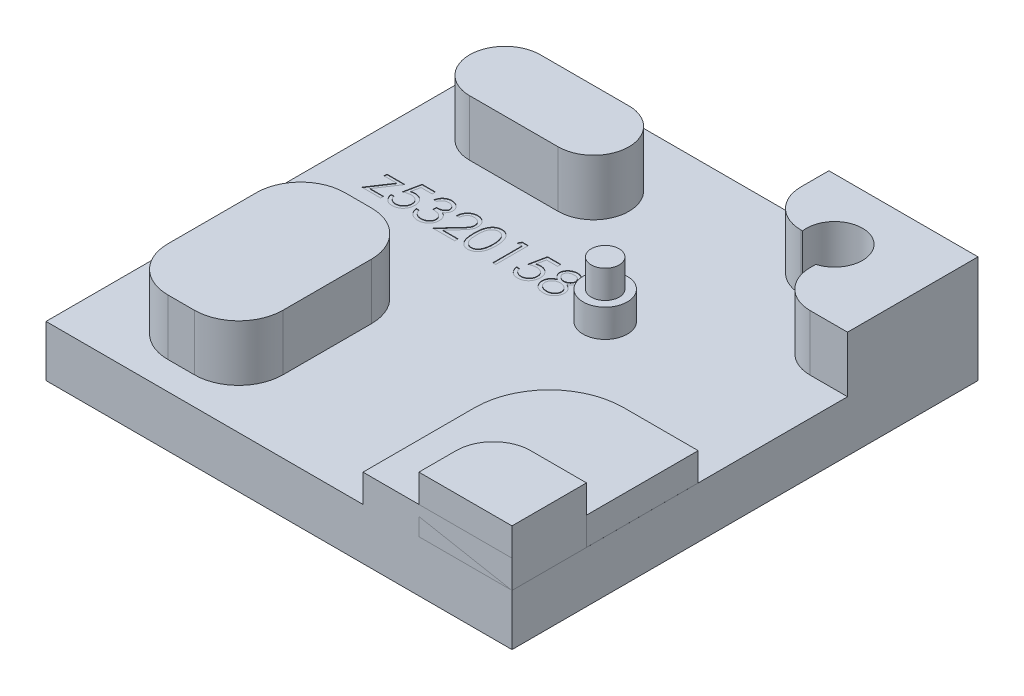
from build123d import *

# Parameters (mm, degrees)
SKETCH1_W            = 50
SKETCH1_H            = 50
BOSS_EXTRUDE4_DEPTH  = 5.5
BOSS_EXTRUDE27_DEPTH = 6
SKETCH10_R           = 2.375
BOSS_EXTRUDE29_DEPTH = 3
CUT_EXTRUDE1_DEPTH   = 0.05
BOSS_EXTRUDE31_DEPTH = 6
BOSS_EXTRUDE32_DEPTH = 6
BOSS_EXTRUDE38_DEPTH = 3
BOSS_EXTRUDE39_DEPTH = 6
SKETCH12_R           = 1.4985
BOSS_EXTRUDE40_DEPTH = 3


with BuildPart() as part:
    # Sketch1 → Boss-Extrude4 (new body)
    with BuildSketch(Plane(origin=(0, 0, 0), x_dir=(1, 0, 0), z_dir=(0, 1, 0))):
        with Locations((2.35426009, -4.035874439)):
            Rectangle(SKETCH1_W, SKETCH1_H)
    extrude(amount=BOSS_EXTRUDE4_DEPTH)

    # Sketch8 → Boss-Extrude27 (add)
    with BuildSketch(Plane(origin=(0, 5.5, 0), x_dir=(1, 0, 0), z_dir=(0, 1, 0))):
        with BuildLine():
            ThreePointArc((11.35426009, 17.964125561), (12.525832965, 15.135698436), (15.35426009, 13.964125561))
            Line((15.35426009, 13.964125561), (15.533330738, 13.964125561))
            ThreePointArc((15.533330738, 13.964125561), (20.09656079, 16.968446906), (19.35426009, 11.555683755))
            Line((19.35426009, 11.555683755), (19.35426009, 10.964125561))
            ThreePointArc((19.35426009, 10.964125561), (20.525832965, 8.135698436), (23.35426009, 6.964125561))
            Line((23.35426009, 6.964125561), (27.35426009, 6.964125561))
            Line((27.35426009, 6.964125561), (27.35426009, 20.964125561))
            Line((27.35426009, 20.964125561), (11.35426009, 20.964125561))
            Line((11.35426009, 20.964125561), (11.35426009, 17.964125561))
        make_face()
    extrude(amount=BOSS_EXTRUDE27_DEPTH)

    # Sketch13 → Cut-Extrude1 (cut)
    # profile 1 of 8: a face of its own
    with BuildSketch(Plane(origin=(0, 5.5, 0), x_dir=(1, 0, 0), z_dir=(0, 1, 0))):
        Polygon((-18.036064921, 2.940033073), (-16.106577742, 2.940033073), (-17.59435819, 0.696443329), (-16.151449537, 0.696443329), (-16.151449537, 0.382340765), (-18.170680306, 0.382340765), (-16.682198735, 2.625930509), (-18.036064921, 2.625930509), align=None)
    # profile 2 of 8: a face of its own
    with BuildSketch(Plane(origin=(0, 5.5, 0), x_dir=(1, 0, 0), z_dir=(0, 1, 0))):
        with BuildLine():
            Line((-13.773244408, 3.882340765), (-13.773244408, 3.523366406))
            Line((-13.773244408, 3.523366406), (-14.963749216, 3.523366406))
            Line((-14.963749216, 3.523366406), (-15.152350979, 2.60279349))
            add(Edge.make_bspline(
                [(-15.152350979, 2.60279349), (-15.115295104, 2.613023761), (-15.043505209, 2.632843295), (-14.937545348, 2.654849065), (-14.836953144, 2.66811451), (-14.771677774, 2.66992582), (-14.740091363, 2.670802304)],
                knots=[0, 0, 0, 0, 1.100273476, 2.13160584, 3.095893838, 4, 4, 4, 4], degree=3))
            add(Edge.make_bspline(
                [(-14.740091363, 2.670802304), (-14.701007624, 2.669956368), (-14.624159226, 2.668293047), (-14.511720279, 2.652321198), (-14.404387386, 2.627181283), (-14.302385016, 2.592060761), (-14.205524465, 2.547151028), (-14.114696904, 2.491051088), (-14.028538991, 2.425517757), (-13.948596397, 2.350172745), (-13.876072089, 2.267251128), (-13.812306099, 2.178093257), (-13.758143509, 2.083565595), (-13.714582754, 1.982764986), (-13.67979842, 1.876805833), (-13.656646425, 1.76457325), (-13.641229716, 1.64712513), (-13.63950733, 1.56682056), (-13.638629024, 1.525870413)],
                knots=[0, 0, 0, 0, 1.052922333, 2.070308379, 3.05430497, 4.020497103, 4.973039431, 5.925935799, 6.892292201, 7.88610001, 8.88166317, 9.857072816, 10.836096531, 11.812156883, 12.81219415, 13.836441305, 14.89672472, 16, 16, 16, 16], degree=3))
            add(Edge.make_bspline(
                [(-13.638629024, 1.525870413), (-13.639294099, 1.497348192), (-13.640615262, 1.440689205), (-13.647333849, 1.356545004), (-13.660269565, 1.274182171), (-13.677637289, 1.193589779), (-13.700179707, 1.114920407), (-13.727468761, 1.037948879), (-13.760864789, 0.963154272), (-13.797496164, 0.889828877), (-13.838742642, 0.81963037), (-13.884521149, 0.753981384), (-13.932886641, 0.691897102), (-13.984928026, 0.634043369), (-14.041129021, 0.580800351), (-14.100808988, 0.53185207), (-14.163491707, 0.486370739), (-14.230146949, 0.446202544), (-14.299289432, 0.409239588), (-14.37191765, 0.378916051), (-14.44637835, 0.351805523), (-14.523743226, 0.330195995), (-14.603837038, 0.31326344), (-14.686791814, 0.30176284), (-14.772172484, 0.293386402), (-14.830047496, 0.292862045), (-14.859282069, 0.292597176)],
                knots=[0, 0, 0, 0, 1.056347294, 2.098418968, 3.122841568, 4.141288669, 5.149314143, 6.15115421, 7.162517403, 8.180376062, 9.185164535, 10.17417709, 11.141909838, 12.097768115, 13.052685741, 14.0056014, 14.954263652, 15.917497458, 16.885230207, 17.854509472, 18.828990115, 19.81800267, 20.826176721, 21.857883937, 22.917946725, 24, 24, 24, 24], degree=3))
            add(Edge.make_bspline(
                [(-14.859282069, 0.292597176), (-14.894156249, 0.293288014), (-14.96276708, 0.294647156), (-15.063287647, 0.308865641), (-15.160002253, 0.329229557), (-15.252132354, 0.359865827), (-15.340503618, 0.398253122), (-15.423926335, 0.446769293), (-15.504532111, 0.501748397), (-15.579044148, 0.56662875), (-15.648200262, 0.637544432), (-15.710106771, 0.714502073), (-15.765240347, 0.796231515), (-15.812718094, 0.883129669), (-15.853216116, 0.9749682), (-15.885031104, 1.072091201), (-15.910709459, 1.173991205), (-15.921572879, 1.244144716), (-15.927090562, 1.279776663)],
                knots=[0, 0, 0, 0, 1.0467383, 2.05933395, 3.04377827, 4.011590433, 4.970194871, 5.932262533, 6.905835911, 7.896367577, 8.894135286, 9.877477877, 10.858688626, 11.851381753, 12.8477658, 13.868841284, 14.917554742, 16, 16, 16, 16], degree=3))
            Line((-15.927090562, 1.279776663), (-15.612987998, 1.279776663))
            add(Edge.make_bspline(
                [(-15.612987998, 1.279776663), (-15.605259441, 1.24640021), (-15.590404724, 1.182248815), (-15.557798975, 1.092117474), (-15.5179331, 1.01179825), (-15.470528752, 0.940228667), (-15.413978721, 0.87781967), (-15.349449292, 0.822202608), (-15.277101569, 0.772027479), (-15.196708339, 0.730204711), (-15.11189526, 0.694535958), (-15.02312805, 0.670784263), (-14.932823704, 0.65408337), (-14.871745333, 0.652411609), (-14.841052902, 0.651571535)],
                knots=[0, 0, 0, 0, 1.136247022, 2.183929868, 3.172523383, 4.106158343, 5.02341133, 5.958108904, 6.928429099, 7.938127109, 8.96079061, 9.975095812, 10.982467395, 12, 12, 12, 12], degree=3))
            add(Edge.make_bspline(
                [(-14.841052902, 0.651571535), (-14.811094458, 0.652392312), (-14.752106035, 0.654008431), (-14.665294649, 0.666447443), (-14.581481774, 0.685605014), (-14.501494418, 0.714274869), (-14.423932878, 0.749119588), (-14.350759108, 0.793834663), (-14.279856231, 0.845294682), (-14.213428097, 0.904251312), (-14.152588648, 0.969221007), (-14.098832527, 1.0386984), (-14.054055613, 1.112815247), (-14.016321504, 1.190288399), (-13.987668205, 1.271966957), (-13.967227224, 1.357468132), (-13.955224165, 1.447003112), (-13.953572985, 1.508072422), (-13.952731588, 1.539191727)],
                knots=[0, 0, 0, 0, 1.027316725, 2.022795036, 3.002884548, 3.971462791, 4.93288096, 5.914575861, 6.907176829, 7.935150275, 8.956128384, 9.956726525, 10.942570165, 11.921478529, 12.907843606, 13.90538589, 14.932640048, 16, 16, 16, 16], degree=3))
            add(Edge.make_bspline(
                [(-13.952731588, 1.539191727), (-13.953390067, 1.567267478), (-13.954678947, 1.622221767), (-13.965209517, 1.702620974), (-13.98352649, 1.778694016), (-14.00895037, 1.85080825), (-14.041229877, 1.919031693), (-14.08067619, 1.983434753), (-14.128029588, 2.043168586), (-14.182121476, 2.09826114), (-14.241379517, 2.149106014), (-14.30682326, 2.192450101), (-14.377083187, 2.228914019), (-14.451312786, 2.260382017), (-14.531277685, 2.282982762), (-14.615394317, 2.299950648), (-14.704571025, 2.30976601), (-14.765541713, 2.311127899), (-14.796882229, 2.311827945)],
                knots=[0, 0, 0, 0, 1.045622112, 2.046656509, 3.013763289, 3.955457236, 4.890082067, 5.820317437, 6.762574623, 7.722996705, 8.69280354, 9.665887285, 10.63943826, 11.638615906, 12.663482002, 13.728887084, 14.832589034, 16, 16, 16, 16], degree=3))
            add(Edge.make_bspline(
                [(-14.796882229, 2.311827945), (-14.824011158, 2.311247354), (-14.880025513, 2.31004858), (-14.96594834, 2.301222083), (-15.056240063, 2.286982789), (-15.150554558, 2.267396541), (-15.249175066, 2.241765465), (-15.351893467, 2.211050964), (-15.458925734, 2.174328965), (-15.531043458, 2.146596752), (-15.568116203, 2.132340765)],
                knots=[0, 0, 0, 0, 0.817624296, 1.688186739, 2.600797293, 3.572016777, 4.590301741, 5.671205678, 6.80286297, 8, 8, 8, 8], degree=3))
            Line((-15.568116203, 2.132340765), (-15.209141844, 3.882340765))
            Line((-15.209141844, 3.882340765), (-13.773244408, 3.882340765))
        make_face()
    # profile 3 of 8: a face of its own
    with BuildSketch(Plane(origin=(0, 5.5, 0), x_dir=(1, 0, 0), z_dir=(0, 1, 0))):
        with BuildLine():
            Line((-12.830936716, 3.074648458), (-13.14503928, 3.074648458))
            add(Edge.make_bspline(
                [(-13.14503928, 3.074648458), (-13.136529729, 3.109880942), (-13.119894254, 3.178757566), (-13.08519668, 3.277164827), (-13.047397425, 3.370288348), (-13.002008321, 3.456384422), (-12.952499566, 3.537183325), (-12.895776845, 3.610852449), (-12.834457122, 3.679265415), (-12.766632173, 3.739978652), (-12.695503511, 3.794956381), (-12.620068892, 3.841831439), (-12.541845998, 3.882155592), (-12.460292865, 3.915375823), (-12.375166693, 3.940401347), (-12.28723707, 3.958558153), (-12.19627357, 3.970349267), (-12.134525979, 3.97150003), (-12.103172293, 3.972084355)],
                knots=[0, 0, 0, 0, 1.162005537, 2.271625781, 3.343758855, 4.383309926, 5.390229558, 6.379919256, 7.361854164, 8.333198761, 9.295911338, 10.242430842, 11.177959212, 12.116337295, 13.062827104, 14.020064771, 14.994644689, 16, 16, 16, 16], degree=3))
            add(Edge.make_bspline(
                [(-12.103172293, 3.972084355), (-12.057489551, 3.970705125), (-11.96712054, 3.967976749), (-11.834357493, 3.943062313), (-11.706330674, 3.90363718), (-11.584441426, 3.849163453), (-11.471222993, 3.78197614), (-11.370486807, 3.702011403), (-11.283598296, 3.610812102), (-11.210703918, 3.510079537), (-11.153628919, 3.402424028), (-11.111542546, 3.291623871), (-11.085920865, 3.1779419), (-11.082600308, 3.10118462), (-11.080936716, 3.062729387)],
                knots=[0, 0, 0, 0, 1.083050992, 2.142477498, 3.193116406, 4.255571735, 5.30263384, 6.308962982, 7.297363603, 8.282367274, 9.249857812, 10.179914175, 11.08814088, 12, 12, 12, 12], degree=3))
            add(Edge.make_bspline(
                [(-11.080936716, 3.062729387), (-11.082100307, 3.025722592), (-11.084377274, 2.953306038), (-11.10371098, 2.847584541), (-11.136247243, 2.74794294), (-11.181317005, 2.653961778), (-11.239658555, 2.566236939), (-11.310331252, 2.484571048), (-11.393833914, 2.40860189), (-11.457112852, 2.365082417), (-11.489690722, 2.342677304)],
                knots=[0, 0, 0, 0, 1.024540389, 2.004866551, 2.965041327, 3.920577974, 4.882998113, 5.874504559, 6.905732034, 8, 8, 8, 8], degree=3))
            add(Edge.make_bspline(
                [(-11.489690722, 2.342677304), (-11.452458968, 2.324699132), (-11.378692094, 2.289079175), (-11.278141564, 2.219223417), (-11.186863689, 2.13856707), (-11.13595997, 2.075624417), (-11.110383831, 2.043999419)],
                knots=[0, 0, 0, 0, 1.015518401, 2.012035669, 3.001164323, 4, 4, 4, 4], degree=3))
            add(Edge.make_bspline(
                [(-11.110383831, 2.043999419), (-11.093542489, 2.020941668), (-11.060135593, 1.975203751), (-11.018900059, 1.901667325), (-10.981490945, 1.827315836), (-10.952340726, 1.75015643), (-10.929766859, 1.671083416), (-10.913630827, 1.58996102), (-10.903606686, 1.506722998), (-10.902171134, 1.450410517), (-10.901449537, 1.422104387)],
                knots=[0, 0, 0, 0, 1.025084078, 2.033381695, 3.024893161, 4.013698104, 4.991890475, 5.976764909, 6.982997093, 8, 8, 8, 8], degree=3))
            add(Edge.make_bspline(
                [(-10.901449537, 1.422104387), (-10.90324405, 1.373094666), (-10.906824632, 1.275305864), (-10.938828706, 1.130831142), (-10.988441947, 0.98960564), (-11.058898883, 0.854530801), (-11.144766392, 0.72815042), (-11.246923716, 0.615074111), (-11.364210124, 0.517875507), (-11.495015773, 0.436665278), (-11.636732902, 0.371747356), (-11.788308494, 0.326689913), (-11.947558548, 0.297343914), (-12.056765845, 0.294197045), (-12.112286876, 0.292597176)],
                knots=[0, 0, 0, 0, 0.955779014, 1.907060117, 2.875433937, 3.871313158, 4.872415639, 5.851225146, 6.836215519, 7.83643374, 8.849228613, 9.86973379, 10.916971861, 12, 12, 12, 12], degree=3))
            add(Edge.make_bspline(
                [(-12.112286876, 0.292597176), (-12.149706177, 0.293465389), (-12.223334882, 0.295173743), (-12.33157838, 0.306852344), (-12.434900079, 0.328182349), (-12.533439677, 0.356885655), (-12.627284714, 0.393277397), (-12.716148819, 0.438596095), (-12.800578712, 0.491907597), (-12.879777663, 0.553841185), (-12.953736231, 0.623122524), (-13.020488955, 0.700981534), (-13.081148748, 0.785978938), (-13.134091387, 0.879101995), (-13.18172834, 0.979147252), (-13.220909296, 1.08739575), (-13.255394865, 1.202879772), (-13.271428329, 1.283357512), (-13.279654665, 1.324648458)],
                knots=[0, 0, 0, 0, 1.048658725, 2.063410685, 3.046034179, 4.001477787, 4.936774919, 5.862367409, 6.792675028, 7.730719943, 8.675894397, 9.627829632, 10.600096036, 11.597688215, 12.626045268, 13.701542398, 14.82072376, 16, 16, 16, 16], degree=3))
            Line((-13.279654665, 1.324648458), (-12.965552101, 1.324648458))
            add(Edge.make_bspline(
                [(-12.965552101, 1.324648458), (-12.957368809, 1.297699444), (-12.941451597, 1.245281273), (-12.914357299, 1.169840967), (-12.883489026, 1.100682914), (-12.850374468, 1.037299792), (-12.815596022, 0.979067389), (-12.776681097, 0.92752552), (-12.736511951, 0.880410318), (-12.706232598, 0.853865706), (-12.691413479, 0.840874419)],
                knots=[0, 0, 0, 0, 1.198163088, 2.33053128, 3.407730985, 4.417276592, 5.372219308, 6.28897303, 7.162600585, 8, 8, 8, 8], degree=3))
            add(Edge.make_bspline(
                [(-12.691413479, 0.840874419), (-12.671816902, 0.825766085), (-12.632684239, 0.795596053), (-12.568916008, 0.757094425), (-12.501851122, 0.7237334), (-12.430036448, 0.698249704), (-12.355021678, 0.676672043), (-12.275594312, 0.662551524), (-12.192455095, 0.652863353), (-12.135687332, 0.652008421), (-12.106677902, 0.651571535)],
                knots=[0, 0, 0, 0, 0.946170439, 1.889420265, 2.845303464, 3.807233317, 4.801018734, 5.828864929, 6.890507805, 8, 8, 8, 8], degree=3))
            add(Edge.make_bspline(
                [(-12.106677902, 0.651571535), (-12.073924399, 0.65218744), (-12.009877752, 0.653391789), (-11.916422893, 0.664467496), (-11.827515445, 0.68059791), (-11.74414252, 0.705510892), (-11.665212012, 0.736291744), (-11.591830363, 0.774940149), (-11.523034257, 0.820284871), (-11.459704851, 0.87182403), (-11.402759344, 0.928245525), (-11.35261983, 0.987258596), (-11.309995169, 1.048614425), (-11.275611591, 1.112652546), (-11.24846104, 1.179107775), (-11.22997784, 1.248166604), (-11.217126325, 1.319263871), (-11.216079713, 1.36759284), (-11.215552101, 1.39195615)],
                knots=[0, 0, 0, 0, 1.217147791, 2.380027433, 3.494444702, 4.572153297, 5.609568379, 6.639424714, 7.649109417, 8.668170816, 9.669597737, 10.625200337, 11.543417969, 12.441394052, 13.322311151, 14.205496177, 15.095365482, 16, 16, 16, 16], degree=3))
            add(Edge.make_bspline(
                [(-11.215552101, 1.39195615), (-11.217082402, 1.424567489), (-11.220135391, 1.489627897), (-11.24344397, 1.585345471), (-11.281782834, 1.677568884), (-11.335455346, 1.764724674), (-11.400791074, 1.845500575), (-11.477155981, 1.917572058), (-11.565184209, 1.977042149), (-11.646204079, 2.018130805), (-11.717969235, 2.04616788), (-11.779384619, 2.064842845), (-11.848141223, 2.080656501), (-11.923407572, 2.095368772), (-12.005750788, 2.10789012), (-12.095081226, 2.118331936), (-12.191416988, 2.126686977), (-12.258108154, 2.130418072), (-12.292475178, 2.132340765)],
                knots=[0, 0, 0, 0, 1.07054697, 2.135767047, 3.216561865, 4.33974944, 5.486079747, 6.621378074, 7.775625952, 8.963672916, 9.598146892, 10.304877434, 11.070270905, 11.915000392, 12.823868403, 13.805723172, 14.86925407, 16, 16, 16, 16], degree=3))
            Line((-12.292475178, 2.132340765), (-12.292475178, 2.491315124))
            add(Edge.make_bspline(
                [(-12.292475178, 2.491315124), (-12.249174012, 2.492049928), (-12.164357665, 2.493489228), (-12.040463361, 2.510897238), (-11.921990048, 2.534977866), (-11.811563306, 2.571863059), (-11.710914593, 2.614703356), (-11.623594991, 2.664555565), (-11.550827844, 2.719970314), (-11.492966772, 2.781802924), (-11.449437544, 2.848117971), (-11.417610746, 2.917234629), (-11.39881042, 2.98975869), (-11.396300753, 3.039253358), (-11.39503928, 3.064131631)],
                knots=[0, 0, 0, 0, 1.321986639, 2.589447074, 3.816329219, 5.01088745, 6.139805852, 7.153945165, 8.075214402, 8.924034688, 9.728124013, 10.488707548, 11.240355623, 12, 12, 12, 12], degree=3))
            add(Edge.make_bspline(
                [(-11.39503928, 3.064131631), (-11.395453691, 3.082409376), (-11.396278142, 3.118772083), (-11.40667542, 3.171897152), (-11.422299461, 3.223398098), (-11.44377919, 3.273055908), (-11.472529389, 3.320526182), (-11.506935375, 3.366213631), (-11.547903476, 3.40985741), (-11.594848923, 3.450537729), (-11.645260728, 3.489306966), (-11.700510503, 3.522220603), (-11.758932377, 3.550365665), (-11.820591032, 3.573575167), (-11.885686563, 3.591034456), (-11.95391312, 3.603570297), (-12.025400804, 3.611407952), (-12.074172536, 3.612536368), (-12.098965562, 3.613109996)],
                knots=[0, 0, 0, 0, 0.884392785, 1.759457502, 2.611959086, 3.489218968, 4.37281399, 5.2945488, 6.255912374, 7.266815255, 8.301784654, 9.332968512, 10.37626691, 11.440494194, 12.520033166, 13.637162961, 14.798855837, 16, 16, 16, 16], degree=3))
            add(Edge.make_bspline(
                [(-12.098965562, 3.613109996), (-12.13881723, 3.611718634), (-12.216656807, 3.60900098), (-12.328871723, 3.585197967), (-12.433191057, 3.547219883), (-12.512929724, 3.501886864), (-12.571812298, 3.45713643), (-12.613889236, 3.418054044), (-12.655209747, 3.37462122), (-12.693055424, 3.324162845), (-12.7313294, 3.270096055), (-12.766173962, 3.209672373), (-12.800033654, 3.144467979), (-12.820436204, 3.098372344), (-12.830936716, 3.074648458)],
                knots=[0, 0, 0, 0, 1.472543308, 2.876219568, 4.221790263, 5.565193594, 6.249813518, 6.953379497, 7.687249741, 8.463570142, 9.283606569, 10.136032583, 11.040678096, 12, 12, 12, 12], degree=3))
        make_face()
    # profile 4 of 8: a face of its own
    with BuildSketch(Plane(origin=(0, 5.5, 0), x_dir=(1, 0, 0), z_dir=(0, 1, 0))):
        with BuildLine():
            Line((-10.138629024, 2.805417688), (-10.452731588, 2.805417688))
            add(Edge.make_bspline(
                [(-10.452731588, 2.805417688), (-10.450684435, 2.847088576), (-10.446663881, 2.928929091), (-10.427835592, 3.048252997), (-10.400894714, 3.162307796), (-10.36280326, 3.27017771), (-10.315496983, 3.372816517), (-10.258766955, 3.469816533), (-10.191573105, 3.560807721), (-10.115366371, 3.644946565), (-10.032597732, 3.722134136), (-9.943291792, 3.788789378), (-9.849446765, 3.84510705), (-9.751347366, 3.892188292), (-9.647886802, 3.927528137), (-9.540003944, 3.953749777), (-9.427224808, 3.969526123), (-9.350384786, 3.971221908), (-9.311305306, 3.972084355)],
                knots=[0, 0, 0, 0, 1.10065271, 2.161652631, 3.183658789, 4.190468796, 5.17591951, 6.163126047, 7.15150782, 8.156236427, 9.156009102, 10.134482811, 11.092018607, 12.041330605, 13.001268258, 13.972401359, 14.968799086, 16, 16, 16, 16], degree=3))
            add(Edge.make_bspline(
                [(-9.311305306, 3.972084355), (-9.272927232, 3.971185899), (-9.197515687, 3.969420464), (-9.087453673, 3.954259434), (-8.982676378, 3.930513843), (-8.883388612, 3.897198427), (-8.790382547, 3.852413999), (-8.702959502, 3.79861646), (-8.620078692, 3.736396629), (-8.545471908, 3.663142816), (-8.476963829, 3.584940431), (-8.417861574, 3.501452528), (-8.36724841, 3.415223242), (-8.32506073, 3.32559504), (-8.294004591, 3.231724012), (-8.270426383, 3.134976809), (-8.25709897, 3.034351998), (-8.255053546, 2.966245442), (-8.254013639, 2.931619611)],
                knots=[0, 0, 0, 0, 1.111607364, 2.184268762, 3.212621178, 4.221274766, 5.211760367, 6.196651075, 7.1921475, 8.207485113, 9.220403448, 10.201281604, 11.166441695, 12.114753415, 13.065576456, 14.026450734, 14.996634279, 16, 16, 16, 16], degree=3))
            add(Edge.make_bspline(
                [(-8.254013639, 2.931619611), (-8.255706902, 2.882871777), (-8.259063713, 2.786231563), (-8.28777809, 2.6442167), (-8.332624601, 2.506623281), (-8.386621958, 2.395885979), (-8.441094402, 2.306652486), (-8.490181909, 2.233183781), (-8.54764672, 2.154078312), (-8.614325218, 2.069600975), (-8.688838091, 1.97909007), (-8.771860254, 1.882600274), (-8.863983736, 1.781128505), (-8.928642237, 1.711822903), (-8.962146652, 1.675910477)],
                knots=[0, 0, 0, 0, 1.184426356, 2.348067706, 3.509069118, 4.696110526, 5.333549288, 6.050745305, 6.844228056, 7.710549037, 8.667450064, 9.695053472, 10.805634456, 12, 12, 12, 12], degree=3))
            Line((-8.962146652, 1.675910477), (-9.837847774, 0.741315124))
            Line((-9.837847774, 0.741315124), (-8.209141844, 0.741315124))
            Line((-8.209141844, 0.741315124), (-8.209141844, 0.382340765))
            Line((-8.209141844, 0.382340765), (-10.587346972, 0.382340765))
            Line((-10.587346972, 0.382340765), (-9.229975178, 1.830858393))
            add(Edge.make_bspline(
                [(-9.229975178, 1.830858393), (-9.196927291, 1.8653567), (-9.133449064, 1.931620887), (-9.043666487, 2.028363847), (-8.963027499, 2.118113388), (-8.891010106, 2.200699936), (-8.8291766, 2.277331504), (-8.774304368, 2.345526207), (-8.730338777, 2.408280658), (-8.682623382, 2.481021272), (-8.6364094, 2.569833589), (-8.596697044, 2.678367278), (-8.572482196, 2.790094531), (-8.56957736, 2.865596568), (-8.568116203, 2.90357474)],
                knots=[0, 0, 0, 0, 1.329631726, 2.553950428, 3.673215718, 4.687767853, 5.603093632, 6.413772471, 7.123043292, 7.734684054, 8.834405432, 9.900288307, 10.943827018, 12, 12, 12, 12], degree=3))
            add(Edge.make_bspline(
                [(-8.568116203, 2.90357474), (-8.568751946, 2.927456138), (-8.570004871, 2.974521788), (-8.581062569, 3.043527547), (-8.597773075, 3.110092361), (-8.621718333, 3.17442098), (-8.653325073, 3.235866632), (-8.691798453, 3.294504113), (-8.736188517, 3.351193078), (-8.787539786, 3.404346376), (-8.843951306, 3.453027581), (-8.903545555, 3.496151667), (-8.96659566, 3.532190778), (-9.032835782, 3.561734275), (-9.102081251, 3.584909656), (-9.174465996, 3.600968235), (-9.249790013, 3.611050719), (-9.301223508, 3.612414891), (-9.327431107, 3.613109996)],
                knots=[0, 0, 0, 0, 0.991446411, 1.95395049, 2.89581595, 3.838931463, 4.798493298, 5.75982156, 6.748411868, 7.785213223, 8.824556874, 9.840280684, 10.836137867, 11.835679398, 12.848801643, 13.863922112, 14.911575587, 16, 16, 16, 16], degree=3))
            add(Edge.make_bspline(
                [(-9.327431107, 3.613109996), (-9.35480194, 3.612394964), (-9.408553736, 3.610990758), (-9.487472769, 3.601168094), (-9.562758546, 3.584222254), (-9.634600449, 3.56104558), (-9.703120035, 3.531587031), (-9.767984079, 3.494895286), (-9.829046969, 3.451111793), (-9.886423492, 3.401471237), (-9.939287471, 3.346203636), (-9.985734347, 3.284593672), (-10.026318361, 3.217766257), (-10.061727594, 3.145901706), (-10.090483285, 3.068347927), (-10.112456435, 2.985380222), (-10.129843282, 2.89735884), (-10.135651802, 2.836573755), (-10.138629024, 2.805417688)],
                knots=[0, 0, 0, 0, 1.031018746, 2.02475058, 2.990194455, 3.934040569, 4.864654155, 5.795059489, 6.735614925, 7.690564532, 8.649604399, 9.611025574, 10.590972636, 11.591080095, 12.624614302, 13.701020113, 14.821632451, 16, 16, 16, 16], degree=3))
        make_face()
    # profile 5 of 8: a face of its own
    with BuildSketch(Plane(origin=(0, 5.5, 0), x_dir=(1, 0, 0), z_dir=(0, 1, 0))):
        with BuildLine():
            add(Edge.make_bspline(
                [(-7.89503928, 2.130938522), (-7.894711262, 2.187035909), (-7.894074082, 2.296005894), (-7.886985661, 2.454790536), (-7.875210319, 2.603750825), (-7.859072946, 2.742893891), (-7.839434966, 2.872255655), (-7.813219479, 2.991490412), (-7.783406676, 3.101150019), (-7.748854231, 3.201592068), (-7.709866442, 3.294169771), (-7.667432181, 3.380594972), (-7.619867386, 3.460736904), (-7.569890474, 3.535874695), (-7.515478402, 3.604778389), (-7.458179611, 3.668421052), (-7.395757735, 3.725331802), (-7.330334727, 3.777178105), (-7.261318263, 3.822627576), (-7.190675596, 3.862660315), (-7.117920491, 3.896860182), (-7.042854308, 3.923750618), (-6.96615175, 3.945961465), (-6.887544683, 3.961150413), (-6.806903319, 3.970707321), (-6.752471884, 3.971620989), (-6.724867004, 3.972084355)],
                knots=[0, 0, 0, 0, 1.646270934, 3.197905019, 4.663502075, 6.030701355, 7.308322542, 8.50163776, 9.611534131, 10.641858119, 11.616356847, 12.558055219, 13.465016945, 14.349605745, 15.204443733, 16.039544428, 16.859896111, 17.680448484, 18.487036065, 19.28249412, 20.06191084, 20.843045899, 21.620316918, 22.403196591, 23.190181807, 24, 24, 24, 24], degree=3))
            add(Edge.make_bspline(
                [(-6.724867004, 3.972084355), (-6.697031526, 3.97159654), (-6.641675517, 3.970626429), (-6.559835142, 3.961302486), (-6.47988546, 3.945831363), (-6.402167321, 3.923910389), (-6.326042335, 3.896714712), (-6.252105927, 3.862627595), (-6.179898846, 3.822948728), (-6.110568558, 3.77632485), (-6.043353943, 3.724342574), (-5.97990598, 3.665579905), (-5.920218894, 3.600630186), (-5.863543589, 3.530188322), (-5.811487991, 3.452903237), (-5.761914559, 3.370119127), (-5.717542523, 3.280388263), (-5.674807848, 3.185207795), (-5.637920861, 3.081944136), (-5.604654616, 2.971179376), (-5.577775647, 2.851605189), (-5.555386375, 2.723848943), (-5.538041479, 2.58744146), (-5.525408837, 2.442675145), (-5.518735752, 2.289454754), (-5.517479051, 2.184696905), (-5.516834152, 2.130938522)],
                knots=[0, 0, 0, 0, 0.810914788, 1.612654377, 2.396697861, 3.181598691, 3.963628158, 4.749916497, 5.551656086, 6.361998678, 7.18212741, 8.025565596, 8.878627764, 9.750805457, 10.657531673, 11.591944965, 12.560506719, 13.57287815, 14.630710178, 15.753379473, 16.941251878, 18.199788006, 19.531962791, 20.947069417, 22.433333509, 24, 24, 24, 24], degree=3))
            add(Edge.make_bspline(
                [(-5.516834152, 2.130938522), (-5.517485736, 2.077414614), (-5.518755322, 1.973125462), (-5.525334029, 1.820594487), (-5.53829266, 1.676596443), (-5.554502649, 1.540785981), (-5.576953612, 1.413728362), (-5.604558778, 1.294983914), (-5.635209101, 1.184039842), (-5.673043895, 1.08180503), (-5.714454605, 0.986853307), (-5.759509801, 0.898186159), (-5.807779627, 0.815019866), (-5.860368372, 0.738020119), (-5.916421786, 0.666641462), (-5.977139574, 0.60214384), (-6.040810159, 0.542973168), (-6.108222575, 0.49032154), (-6.178634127, 0.444236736), (-6.250593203, 0.403022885), (-6.325376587, 0.36979019), (-6.40128954, 0.341255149), (-6.479417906, 0.319454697), (-6.559664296, 0.304380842), (-6.641620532, 0.293808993), (-6.697022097, 0.293002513), (-6.724867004, 0.292597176)],
                knots=[0, 0, 0, 0, 1.561518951, 3.042555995, 4.452378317, 5.7783523, 7.031515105, 8.214008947, 9.334062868, 10.386615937, 11.391082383, 12.354592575, 13.286541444, 14.194233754, 15.072674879, 15.931287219, 16.775624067, 17.606195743, 18.42308326, 19.229000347, 20.022332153, 20.807536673, 21.593273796, 22.3848459, 23.188221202, 24, 24, 24, 24], degree=3))
            add(Edge.make_bspline(
                [(-6.724867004, 0.292597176), (-6.752471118, 0.293063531), (-6.806901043, 0.293983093), (-6.887553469, 0.303496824), (-6.965835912, 0.318792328), (-7.042134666, 0.340208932), (-7.116841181, 0.366423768), (-7.188937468, 0.400577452), (-7.259225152, 0.439911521), (-7.327516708, 0.484706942), (-7.392528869, 0.536028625), (-7.454627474, 0.592792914), (-7.512252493, 0.656416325), (-7.565886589, 0.725894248), (-7.616860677, 0.800587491), (-7.66375005, 0.881515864), (-7.707120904, 0.968358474), (-7.746764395, 1.061676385), (-7.781913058, 1.162831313), (-7.812960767, 1.272980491), (-7.837474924, 1.393096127), (-7.858457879, 1.522213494), (-7.875382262, 1.660887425), (-7.886936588, 1.809193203), (-7.894077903, 1.967038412), (-7.894712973, 2.075308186), (-7.89503928, 2.130938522)],
                knots=[0, 0, 0, 0, 0.810891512, 1.598919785, 2.382837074, 3.152667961, 3.926044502, 4.706494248, 5.493654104, 6.291793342, 7.103789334, 7.925228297, 8.761435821, 9.622817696, 10.50288917, 11.416980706, 12.369136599, 13.353924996, 14.394355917, 15.514179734, 16.714354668, 17.994756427, 19.357759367, 20.818452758, 22.365282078, 24, 24, 24, 24], degree=3))
        make_face()
        with BuildLine():
            add(Edge.make_bspline(
                [(-7.580936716, 2.132340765), (-7.580817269, 2.085592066), (-7.580585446, 1.994862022), (-7.574529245, 1.863018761), (-7.566279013, 1.740048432), (-7.555637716, 1.625794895), (-7.539834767, 1.520644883), (-7.52212798, 1.4238752), (-7.50057989, 1.335997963), (-7.475084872, 1.256410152), (-7.446045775, 1.183761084), (-7.414339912, 1.116159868), (-7.380279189, 1.052807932), (-7.342160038, 0.994274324), (-7.300644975, 0.94036816), (-7.256671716, 0.890135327), (-7.208599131, 0.845338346), (-7.142095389, 0.791611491), (-7.054298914, 0.736092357), (-6.943678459, 0.687746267), (-6.830010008, 0.657363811), (-6.752858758, 0.653500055), (-6.714350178, 0.651571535)],
                knots=[0, 0, 0, 0, 1.459021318, 2.831673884, 4.118529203, 5.306027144, 6.411944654, 7.436330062, 8.375795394, 9.233974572, 10.042671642, 10.816086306, 11.563610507, 12.285937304, 12.993564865, 13.685989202, 14.367179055, 15.041617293, 16.353048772, 17.594441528, 18.799311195, 20, 20, 20, 20], degree=3))
            add(Edge.make_bspline(
                [(-6.714350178, 0.651571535), (-6.675592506, 0.653169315), (-6.598157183, 0.656361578), (-6.485023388, 0.687160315), (-6.375193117, 0.733629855), (-6.289121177, 0.78857736), (-6.223638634, 0.84090569), (-6.176721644, 0.885520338), (-6.133659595, 0.935476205), (-6.09281752, 0.989375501), (-6.055358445, 1.048247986), (-6.021295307, 1.111810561), (-5.990211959, 1.180239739), (-5.972502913, 1.228009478), (-5.963448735, 1.252432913)],
                knots=[0, 0, 0, 0, 1.353760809, 2.704726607, 4.075137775, 5.516104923, 6.260822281, 7.007110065, 7.778089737, 8.566572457, 9.372053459, 10.217411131, 11.088608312, 12, 12, 12, 12], degree=3))
            add(Edge.make_bspline(
                [(-5.963448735, 1.252432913), (-5.952896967, 1.283662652), (-5.931472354, 1.347072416), (-5.903860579, 1.445436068), (-5.88211518, 1.548638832), (-5.862551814, 1.656063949), (-5.849198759, 1.76850365), (-5.838450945, 1.885610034), (-5.832120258, 2.007471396), (-5.831335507, 2.090266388), (-5.830936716, 2.132340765)],
                knots=[0, 0, 0, 0, 0.884706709, 1.796334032, 2.740027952, 3.714592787, 4.726048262, 5.777819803, 6.87074269, 8, 8, 8, 8], degree=3))
            add(Edge.make_bspline(
                [(-5.830936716, 2.132340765), (-5.831486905, 2.174408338), (-5.832563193, 2.256701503), (-5.836677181, 2.377219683), (-5.847300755, 2.491687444), (-5.859099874, 2.600597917), (-5.876497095, 2.70334822), (-5.895254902, 2.800798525), (-5.920456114, 2.89174155), (-5.947375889, 2.977601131), (-5.978186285, 3.057401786), (-6.012102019, 3.131515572), (-6.048323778, 3.200300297), (-6.087666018, 3.263567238), (-6.129661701, 3.321599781), (-6.175419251, 3.373234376), (-6.223123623, 3.420071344), (-6.289940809, 3.473533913), (-6.377415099, 3.528045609), (-6.486260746, 3.578211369), (-6.599531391, 3.607019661), (-6.676104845, 3.611081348), (-6.714350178, 3.613109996)],
                knots=[0, 0, 0, 0, 1.31362396, 2.569729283, 3.763502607, 4.902122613, 5.988968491, 7.01645872, 7.998833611, 8.933434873, 9.825090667, 10.667526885, 11.477055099, 12.250526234, 12.991942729, 13.710640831, 14.402115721, 15.076753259, 16.378508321, 17.609869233, 18.806226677, 20, 20, 20, 20], degree=3))
            add(Edge.make_bspline(
                [(-6.714350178, 3.613109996), (-6.75306077, 3.611078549), (-6.830552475, 3.607011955), (-6.94500043, 3.578318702), (-7.054704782, 3.528305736), (-7.141947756, 3.473353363), (-7.208811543, 3.421015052), (-7.255894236, 3.375628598), (-7.300040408, 3.325982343), (-7.340708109, 3.271580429), (-7.378797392, 3.213115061), (-7.413778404, 3.150126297), (-7.445295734, 3.082294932), (-7.47438027, 3.009678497), (-7.499953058, 2.930097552), (-7.521047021, 2.842328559), (-7.540534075, 2.745866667), (-7.554329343, 2.640147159), (-7.566593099, 2.525865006), (-7.574474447, 2.402587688), (-7.580605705, 2.270523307), (-7.580824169, 2.179324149), (-7.580936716, 2.132340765)],
                knots=[0, 0, 0, 0, 1.207732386, 2.417664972, 3.655092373, 4.956220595, 5.625982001, 6.301752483, 6.994047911, 7.697131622, 8.419323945, 9.170223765, 9.943494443, 10.752040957, 11.610060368, 12.549350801, 13.567764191, 14.679664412, 15.874934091, 17.154273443, 18.533957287, 20, 20, 20, 20], degree=3))
        make_face(mode=Mode.SUBTRACT)
    # profile 6 of 8: a face of its own
    with BuildSketch(Plane(origin=(0, 5.5, 0), x_dir=(1, 0, 0), z_dir=(0, 1, 0))):
        Polygon((-4.458841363, 3.882340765), (-3.811705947, 3.882340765), (-3.811705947, 0.382340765), (-4.125808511, 0.382340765), (-4.125808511, 3.523366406), (-4.664270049, 3.523366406), align=None)
    # profile 7 of 8: a face of its own
    with BuildSketch(Plane(origin=(0, 5.5, 0), x_dir=(1, 0, 0), z_dir=(0, 1, 0))):
        with BuildLine():
            Line((-0.311705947, 3.882340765), (-0.311705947, 3.523366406))
            Line((-0.311705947, 3.523366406), (-1.502210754, 3.523366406))
            Line((-1.502210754, 3.523366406), (-1.690812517, 2.60279349))
            add(Edge.make_bspline(
                [(-1.690812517, 2.60279349), (-1.653756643, 2.613023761), (-1.581966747, 2.632843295), (-1.476006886, 2.654849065), (-1.375414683, 2.66811451), (-1.310139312, 2.66992582), (-1.278552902, 2.670802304)],
                knots=[0, 0, 0, 0, 1.100273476, 2.13160584, 3.095893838, 4, 4, 4, 4], degree=3))
            add(Edge.make_bspline(
                [(-1.278552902, 2.670802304), (-1.239469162, 2.669956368), (-1.162620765, 2.668293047), (-1.050181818, 2.652321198), (-0.942848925, 2.627181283), (-0.840846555, 2.592060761), (-0.743986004, 2.547151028), (-0.653158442, 2.491051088), (-0.567000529, 2.425517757), (-0.487057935, 2.350172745), (-0.414533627, 2.267251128), (-0.350767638, 2.178093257), (-0.296605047, 2.083565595), (-0.253044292, 1.982764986), (-0.218259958, 1.876805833), (-0.195107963, 1.76457325), (-0.179691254, 1.64712513), (-0.177968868, 1.56682056), (-0.177090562, 1.525870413)],
                knots=[0, 0, 0, 0, 1.052922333, 2.070308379, 3.05430497, 4.020497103, 4.973039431, 5.925935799, 6.892292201, 7.88610001, 8.88166317, 9.857072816, 10.836096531, 11.812156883, 12.81219415, 13.836441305, 14.89672472, 16, 16, 16, 16], degree=3))
            add(Edge.make_bspline(
                [(-0.177090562, 1.525870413), (-0.177755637, 1.497348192), (-0.1790768, 1.440689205), (-0.185795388, 1.356545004), (-0.198731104, 1.274182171), (-0.216098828, 1.193589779), (-0.238641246, 1.114920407), (-0.2659303, 1.037948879), (-0.299326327, 0.963154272), (-0.335957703, 0.889828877), (-0.377204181, 0.81963037), (-0.422982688, 0.753981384), (-0.471348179, 0.691897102), (-0.523389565, 0.634043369), (-0.57959056, 0.580800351), (-0.639270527, 0.53185207), (-0.701953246, 0.486370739), (-0.768608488, 0.446202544), (-0.837750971, 0.409239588), (-0.910379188, 0.378916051), (-0.984839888, 0.351805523), (-1.062204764, 0.330195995), (-1.142298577, 0.31326344), (-1.225253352, 0.30176284), (-1.310634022, 0.293386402), (-1.368509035, 0.292862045), (-1.397743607, 0.292597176)],
                knots=[0, 0, 0, 0, 1.056347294, 2.098418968, 3.122841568, 4.141288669, 5.149314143, 6.15115421, 7.162517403, 8.180376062, 9.185164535, 10.17417709, 11.141909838, 12.097768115, 13.052685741, 14.0056014, 14.954263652, 15.917497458, 16.885230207, 17.854509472, 18.828990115, 19.81800267, 20.826176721, 21.857883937, 22.917946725, 24, 24, 24, 24], degree=3))
            add(Edge.make_bspline(
                [(-1.397743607, 0.292597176), (-1.432617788, 0.293288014), (-1.501228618, 0.294647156), (-1.601749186, 0.308865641), (-1.698463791, 0.329229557), (-1.790593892, 0.359865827), (-1.878965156, 0.398253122), (-1.962387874, 0.446769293), (-2.04299365, 0.501748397), (-2.117505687, 0.56662875), (-2.1866618, 0.637544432), (-2.248568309, 0.714502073), (-2.303701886, 0.796231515), (-2.351179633, 0.883129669), (-2.391677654, 0.9749682), (-2.423492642, 1.072091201), (-2.449170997, 1.173991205), (-2.460034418, 1.244144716), (-2.465552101, 1.279776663)],
                knots=[0, 0, 0, 0, 1.0467383, 2.05933395, 3.04377827, 4.011590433, 4.970194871, 5.932262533, 6.905835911, 7.896367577, 8.894135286, 9.877477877, 10.858688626, 11.851381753, 12.8477658, 13.868841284, 14.917554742, 16, 16, 16, 16], degree=3))
            Line((-2.465552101, 1.279776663), (-2.151449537, 1.279776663))
            add(Edge.make_bspline(
                [(-2.151449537, 1.279776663), (-2.143720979, 1.24640021), (-2.128866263, 1.182248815), (-2.096260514, 1.092117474), (-2.056394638, 1.01179825), (-2.00899029, 0.940228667), (-1.95244026, 0.87781967), (-1.887910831, 0.822202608), (-1.815563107, 0.772027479), (-1.735169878, 0.730204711), (-1.650356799, 0.694535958), (-1.561589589, 0.670784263), (-1.471285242, 0.65408337), (-1.410206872, 0.652411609), (-1.37951444, 0.651571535)],
                knots=[0, 0, 0, 0, 1.136247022, 2.183929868, 3.172523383, 4.106158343, 5.02341133, 5.958108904, 6.928429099, 7.938127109, 8.96079061, 9.975095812, 10.982467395, 12, 12, 12, 12], degree=3))
            add(Edge.make_bspline(
                [(-1.37951444, 0.651571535), (-1.349555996, 0.652392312), (-1.290567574, 0.654008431), (-1.203756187, 0.666447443), (-1.119943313, 0.685605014), (-1.039955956, 0.714274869), (-0.962394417, 0.749119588), (-0.889220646, 0.793834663), (-0.818317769, 0.845294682), (-0.751889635, 0.904251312), (-0.691050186, 0.969221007), (-0.637294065, 1.0386984), (-0.592517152, 1.112815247), (-0.554783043, 1.190288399), (-0.526129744, 1.271966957), (-0.505688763, 1.357468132), (-0.493685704, 1.447003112), (-0.492034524, 1.508072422), (-0.491193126, 1.539191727)],
                knots=[0, 0, 0, 0, 1.027316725, 2.022795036, 3.002884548, 3.971462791, 4.93288096, 5.914575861, 6.907176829, 7.935150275, 8.956128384, 9.956726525, 10.942570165, 11.921478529, 12.907843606, 13.90538589, 14.932640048, 16, 16, 16, 16], degree=3))
            add(Edge.make_bspline(
                [(-0.491193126, 1.539191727), (-0.491851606, 1.567267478), (-0.493140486, 1.622221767), (-0.503671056, 1.702620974), (-0.521988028, 1.778694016), (-0.547411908, 1.85080825), (-0.579691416, 1.919031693), (-0.619137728, 1.983434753), (-0.666491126, 2.043168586), (-0.720583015, 2.09826114), (-0.779841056, 2.149106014), (-0.845284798, 2.192450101), (-0.915544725, 2.228914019), (-0.989774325, 2.260382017), (-1.069739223, 2.282982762), (-1.153855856, 2.299950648), (-1.243032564, 2.30976601), (-1.304003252, 2.311127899), (-1.335343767, 2.311827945)],
                knots=[0, 0, 0, 0, 1.045622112, 2.046656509, 3.013763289, 3.955457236, 4.890082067, 5.820317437, 6.762574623, 7.722996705, 8.69280354, 9.665887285, 10.63943826, 11.638615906, 12.663482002, 13.728887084, 14.832589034, 16, 16, 16, 16], degree=3))
            add(Edge.make_bspline(
                [(-1.335343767, 2.311827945), (-1.362472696, 2.311247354), (-1.418487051, 2.31004858), (-1.504409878, 2.301222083), (-1.594701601, 2.286982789), (-1.689016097, 2.267396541), (-1.787636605, 2.241765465), (-1.890355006, 2.211050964), (-1.997387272, 2.174328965), (-2.069504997, 2.146596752), (-2.106577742, 2.132340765)],
                knots=[0, 0, 0, 0, 0.817624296, 1.688186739, 2.600797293, 3.572016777, 4.590301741, 5.671205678, 6.80286297, 8, 8, 8, 8], degree=3))
            Line((-2.106577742, 2.132340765), (-1.747603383, 3.882340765))
            Line((-1.747603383, 3.882340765), (-0.311705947, 3.882340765))
        make_face()
    # profile 8 of 8: a face of its own
    with BuildSketch(Plane(origin=(0, 5.5, 0), x_dir=(1, 0, 0), z_dir=(0, 1, 0))):
        with BuildLine():
            add(Edge.make_bspline(
                [(1.883506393, 2.332160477), (1.91215494, 2.317222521), (1.968029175, 2.288088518), (2.047606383, 2.24117769), (2.120331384, 2.191736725), (2.188221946, 2.142100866), (2.250085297, 2.090369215), (2.30522971, 2.036336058), (2.35501733, 1.981350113), (2.398444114, 1.924480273), (2.43664095, 1.865877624), (2.469653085, 1.805388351), (2.497870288, 1.743145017), (2.520233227, 1.678468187), (2.538655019, 1.612307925), (2.551330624, 1.543809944), (2.558147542, 1.473425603), (2.559436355, 1.425857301), (2.560088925, 1.401771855)],
                knots=[0, 0, 0, 0, 1.272397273, 2.481599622, 3.635517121, 4.734568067, 5.792894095, 6.808321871, 7.773003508, 8.711915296, 9.623354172, 10.525449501, 11.423591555, 12.311487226, 13.218079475, 14.126165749, 15.051214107, 16, 16, 16, 16], degree=3))
            add(Edge.make_bspline(
                [(2.560088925, 1.401771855), (2.559317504, 1.368074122), (2.557790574, 1.301373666), (2.54449059, 1.202927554), (2.524577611, 1.107315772), (2.495498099, 1.014559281), (2.457784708, 0.925169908), (2.411307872, 0.839071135), (2.358696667, 0.754851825), (2.316444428, 0.703032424), (2.295064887, 0.676811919)],
                knots=[0, 0, 0, 0, 1.025265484, 2.029385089, 3.018602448, 3.995076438, 4.983346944, 5.966715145, 6.97116228, 8, 8, 8, 8], degree=3))
            add(Edge.make_bspline(
                [(2.295064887, 0.676811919), (2.267228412, 0.646218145), (2.211899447, 0.585408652), (2.117116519, 0.506457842), (2.013094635, 0.440108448), (1.900236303, 0.386036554), (1.778843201, 0.343950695), (1.648941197, 0.313708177), (1.510277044, 0.296385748), (1.414971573, 0.293881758), (1.366078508, 0.292597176)],
                knots=[0, 0, 0, 0, 0.954267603, 1.896743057, 2.838368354, 3.796610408, 4.779680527, 5.799409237, 6.871065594, 8, 8, 8, 8], degree=3))
            add(Edge.make_bspline(
                [(1.366078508, 0.292597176), (1.31906512, 0.293749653), (1.227581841, 0.295992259), (1.094423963, 0.31118669), (0.970300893, 0.337814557), (0.854490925, 0.374259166), (0.747692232, 0.421669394), (0.650209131, 0.480677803), (0.560635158, 0.548909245), (0.481688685, 0.628323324), (0.411600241, 0.713381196), (0.350032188, 0.801132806), (0.298858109, 0.891586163), (0.255531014, 0.98339253), (0.222362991, 1.077838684), (0.199390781, 1.174438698), (0.184801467, 1.27302384), (0.182860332, 1.339555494), (0.181883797, 1.373025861)],
                knots=[0, 0, 0, 0, 1.256902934, 2.445805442, 3.576955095, 4.645999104, 5.686449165, 6.692658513, 7.68621702, 8.689161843, 9.678783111, 10.630372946, 11.551080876, 12.453998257, 13.34127905, 14.221779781, 15.105423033, 16, 16, 16, 16], degree=3))
            add(Edge.make_bspline(
                [(0.181883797, 1.373025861), (0.182461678, 1.397585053), (0.183603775, 1.446122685), (0.191508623, 1.517832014), (0.204217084, 1.587628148), (0.221476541, 1.655768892), (0.244867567, 1.721758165), (0.273109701, 1.785908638), (0.306041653, 1.848292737), (0.344122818, 1.909251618), (0.388424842, 1.967931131), (0.438588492, 2.025327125), (0.495616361, 2.080548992), (0.55887402, 2.134271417), (0.627638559, 2.187447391), (0.703696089, 2.23720312), (0.785030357, 2.287061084), (0.842835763, 2.31686941), (0.872488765, 2.332160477)],
                knots=[0, 0, 0, 0, 0.941657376, 1.861047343, 2.762797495, 3.66048619, 4.553285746, 5.444104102, 6.34607688, 7.256116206, 8.197091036, 9.162375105, 10.176350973, 11.237807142, 12.343728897, 13.50695164, 14.721116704, 16, 16, 16, 16], degree=3))
            add(Edge.make_bspline(
                [(0.872488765, 2.332160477), (0.83189739, 2.354295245), (0.753301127, 2.397154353), (0.649231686, 2.475901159), (0.559841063, 2.561188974), (0.487586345, 2.654818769), (0.430714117, 2.753865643), (0.391695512, 2.857709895), (0.365299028, 2.964426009), (0.362684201, 3.037332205), (0.361370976, 3.073947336)],
                knots=[0, 0, 0, 0, 1.166880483, 2.259407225, 3.286803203, 4.280235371, 5.237608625, 6.161067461, 7.076446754, 8, 8, 8, 8], degree=3))
            add(Edge.make_bspline(
                [(0.361370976, 3.073947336), (0.3630064, 3.111244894), (0.366293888, 3.186219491), (0.392877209, 3.297825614), (0.436197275, 3.407442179), (0.495118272, 3.514537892), (0.568505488, 3.615488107), (0.656552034, 3.706029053), (0.757155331, 3.785340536), (0.869813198, 3.851916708), (0.991049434, 3.906100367), (1.118965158, 3.94347879), (1.251331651, 3.967914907), (1.34142937, 3.970681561), (1.387112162, 3.972084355)],
                knots=[0, 0, 0, 0, 0.888701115, 1.786444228, 2.72001202, 3.692817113, 4.693886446, 5.687152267, 6.695133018, 7.739871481, 8.800368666, 9.853104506, 10.91144658, 12, 12, 12, 12], degree=3))
            add(Edge.make_bspline(
                [(1.387112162, 3.972084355), (1.431615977, 3.970638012), (1.51937243, 3.967785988), (1.648367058, 3.94399911), (1.771791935, 3.90426959), (1.889221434, 3.850372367), (1.998553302, 3.783985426), (2.095155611, 3.703584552), (2.180488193, 3.613443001), (2.251072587, 3.512523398), (2.309235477, 3.405839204), (2.349736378, 3.294216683), (2.375688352, 3.180067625), (2.378961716, 3.102829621), (2.380601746, 3.064131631)],
                knots=[0, 0, 0, 0, 1.072916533, 2.115669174, 3.151510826, 4.193348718, 5.225979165, 6.227137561, 7.216255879, 8.211077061, 9.189680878, 10.138522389, 11.067357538, 12, 12, 12, 12], degree=3))
            add(Edge.make_bspline(
                [(2.380601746, 3.064131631), (2.379167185, 3.026154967), (2.376349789, 2.951570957), (2.35264985, 2.842844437), (2.312736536, 2.741022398), (2.258242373, 2.644949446), (2.187216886, 2.556367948), (2.100608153, 2.474151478), (1.999106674, 2.39762465), (1.922845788, 2.354438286), (1.883506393, 2.332160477)],
                knots=[0, 0, 0, 0, 0.975232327, 1.915300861, 2.843280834, 3.77672583, 4.742871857, 5.749627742, 6.839139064, 8, 8, 8, 8], degree=3))
        make_face()
        with BuildLine():
            add(Edge.make_bspline(
                [(1.369584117, 3.613109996), (1.345033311, 3.612458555), (1.2970012, 3.611184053), (1.226572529, 3.604525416), (1.159600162, 3.591572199), (1.095384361, 3.574333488), (1.034805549, 3.551045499), (0.977040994, 3.52365049), (0.923073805, 3.490344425), (0.872252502, 3.452983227), (0.826501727, 3.411890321), (0.785897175, 3.369076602), (0.752169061, 3.32370121), (0.723527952, 3.27689285), (0.702746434, 3.227262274), (0.68718213, 3.176331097), (0.676660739, 3.123455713), (0.675872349, 3.087319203), (0.67547354, 3.069039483)],
                knots=[0, 0, 0, 0, 1.203892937, 2.355340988, 3.463153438, 4.544400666, 5.610487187, 6.640501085, 7.674077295, 8.714426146, 9.728707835, 10.68524104, 11.601827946, 12.495867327, 13.368432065, 14.231010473, 15.105153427, 16, 16, 16, 16], degree=3))
            add(Edge.make_bspline(
                [(0.67547354, 3.069039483), (0.676160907, 3.050758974), (0.677519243, 3.014634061), (0.688024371, 2.961288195), (0.703681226, 2.908866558), (0.728331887, 2.858615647), (0.757898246, 2.808792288), (0.794389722, 2.760641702), (0.83787875, 2.713996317), (0.88690619, 2.669252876), (0.940317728, 2.627354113), (0.996901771, 2.590980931), (1.055948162, 2.560546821), (1.116850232, 2.535217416), (1.180228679, 2.515527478), (1.245695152, 2.501558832), (1.313260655, 2.492876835), (1.359041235, 2.491839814), (1.38220431, 2.491315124)],
                knots=[0, 0, 0, 0, 0.873023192, 1.725219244, 2.590779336, 3.480155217, 4.391973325, 5.357036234, 6.360879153, 7.436073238, 8.526419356, 9.601555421, 10.645666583, 11.697338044, 12.750135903, 13.812665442, 14.89329948, 16, 16, 16, 16], degree=3))
            add(Edge.make_bspline(
                [(1.38220431, 2.491315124), (1.411954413, 2.492187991), (1.471160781, 2.493925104), (1.558440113, 2.510076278), (1.643302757, 2.535482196), (1.724841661, 2.570242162), (1.800946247, 2.613870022), (1.868786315, 2.66610304), (1.927783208, 2.725735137), (1.977323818, 2.791837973), (2.015733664, 2.862189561), (2.045635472, 2.932789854), (2.063096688, 3.004392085), (2.065374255, 3.052359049), (2.066499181, 3.076050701)],
                knots=[0, 0, 0, 0, 1.076279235, 2.141928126, 3.20205304, 4.278698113, 5.344010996, 6.36967002, 7.368914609, 8.37248503, 9.349703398, 10.264243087, 11.142681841, 12, 12, 12, 12], degree=3))
            add(Edge.make_bspline(
                [(2.066499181, 3.076050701), (2.065967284, 3.092678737), (2.064911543, 3.125683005), (2.056211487, 3.17442137), (2.041835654, 3.222050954), (2.022372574, 3.268965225), (1.99676278, 3.314505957), (1.966398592, 3.359389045), (1.929514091, 3.402604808), (1.888117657, 3.445160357), (1.841172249, 3.484544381), (1.788768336, 3.519179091), (1.731174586, 3.548591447), (1.668389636, 3.572480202), (1.600644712, 3.590422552), (1.528251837, 3.6038589), (1.450607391, 3.611432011), (1.397177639, 3.612538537), (1.369584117, 3.613109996)],
                knots=[0, 0, 0, 0, 0.814439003, 1.616544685, 2.417341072, 3.248991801, 4.09997495, 4.973547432, 5.9003056, 6.880240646, 7.880314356, 8.896779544, 9.951930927, 11.043077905, 12.18215768, 13.381699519, 14.647792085, 16, 16, 16, 16], degree=3))
        make_face(mode=Mode.SUBTRACT)
        with BuildLine():
            add(Edge.make_bspline(
                [(1.389916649, 2.132340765), (1.358790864, 2.131787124), (1.297729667, 2.130701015), (1.208272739, 2.118611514), (1.122419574, 2.101782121), (1.040459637, 2.076251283), (0.96242754, 2.043054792), (0.887900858, 2.003120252), (0.817449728, 1.955914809), (0.752047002, 1.902038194), (0.692323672, 1.84397874), (0.639925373, 1.782516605), (0.595427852, 1.718794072), (0.559594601, 1.652001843), (0.530182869, 1.583554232), (0.510868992, 1.511746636), (0.49848728, 1.437959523), (0.496824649, 1.387799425), (0.495986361, 1.362509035)],
                knots=[0, 0, 0, 0, 1.140299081, 2.23698856, 3.303958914, 4.344563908, 5.37730929, 6.408454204, 7.439741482, 8.480804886, 9.510774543, 10.48932336, 11.43758569, 12.353841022, 13.263987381, 14.161954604, 15.073269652, 16, 16, 16, 16], degree=3))
            add(Edge.make_bspline(
                [(0.495986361, 1.362509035), (0.49734962, 1.331078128), (0.500054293, 1.268719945), (0.521510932, 1.176556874), (0.555946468, 1.087335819), (0.603971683, 1.001783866), (0.663439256, 0.92183376), (0.736565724, 0.852144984), (0.818806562, 0.790223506), (0.912944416, 0.740142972), (1.015772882, 0.700148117), (1.127264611, 0.672592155), (1.245819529, 0.654350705), (1.327679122, 0.652512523), (1.369584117, 0.651571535)],
                knots=[0, 0, 0, 0, 0.898778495, 1.783155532, 2.693654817, 3.627872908, 4.583023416, 5.533784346, 6.509005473, 7.520592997, 8.575161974, 9.658835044, 10.801527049, 12, 12, 12, 12], degree=3))
            add(Edge.make_bspline(
                [(1.369584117, 0.651571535), (1.402334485, 0.652200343), (1.466142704, 0.653425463), (1.559228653, 0.664239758), (1.647073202, 0.681389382), (1.729506, 0.706332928), (1.80744984, 0.736782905), (1.879583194, 0.775954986), (1.947761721, 0.820507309), (2.008625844, 0.873365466), (2.064059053, 0.929844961), (2.112392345, 0.989635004), (2.154349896, 1.051110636), (2.187280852, 1.115661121), (2.213607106, 1.182048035), (2.23253066, 1.250883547), (2.244206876, 1.322378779), (2.245387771, 1.370877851), (2.245986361, 1.395461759)],
                knots=[0, 0, 0, 0, 1.224942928, 2.386581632, 3.501229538, 4.569074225, 5.605009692, 6.626002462, 7.634866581, 8.645888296, 9.63523824, 10.59253846, 11.518950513, 12.414518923, 13.29783783, 14.186679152, 15.080837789, 16, 16, 16, 16], degree=3))
            add(Edge.make_bspline(
                [(2.245986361, 1.395461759), (2.245080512, 1.419339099), (2.243294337, 1.466421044), (2.231957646, 1.536187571), (2.212041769, 1.603590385), (2.184714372, 1.669440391), (2.148333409, 1.732403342), (2.105488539, 1.794119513), (2.053794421, 1.852875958), (1.995381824, 1.909129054), (1.931722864, 1.96114479), (1.864055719, 2.007159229), (1.792901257, 2.045911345), (1.718410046, 2.077427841), (1.64074749, 2.10221531), (1.559970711, 2.119531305), (1.475985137, 2.130430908), (1.418930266, 2.131696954), (1.389916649, 2.132340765)],
                knots=[0, 0, 0, 0, 0.917430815, 1.809013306, 2.70690318, 3.612392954, 4.541220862, 5.495268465, 6.494511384, 7.542276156, 8.608045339, 9.649016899, 10.681629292, 11.715607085, 12.752076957, 13.808767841, 14.885711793, 16, 16, 16, 16], degree=3))
        make_face(mode=Mode.SUBTRACT)
    extrude(amount=-CUT_EXTRUDE1_DEPTH, mode=Mode.SUBTRACT)

    # Sketch9 → Boss-Extrude32 (add)
    with BuildSketch(Plane(origin=(0, 5.5, 0), x_dir=(1, 0, 0), z_dir=(0, 1, 0))):
        with BuildLine():
            Line((-14.89573991, 16.264125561), (-5.39573991, 16.264125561))
            ThreePointArc((-5.39573991, 16.264125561), (-1.59573991, 12.464125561), (-5.39573991, 8.664125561))
            Line((-5.39573991, 8.664125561), (-14.89573991, 8.664125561))
            ThreePointArc((-14.89573991, 8.664125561), (-18.69573991, 12.464125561), (-14.89573991, 16.264125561))
        make_face()
    extrude(amount=BOSS_EXTRUDE32_DEPTH)

    # Sketch6 → Boss-Extrude38 (add)
    with BuildSketch(Plane(origin=(0, 5.5, 0), x_dir=(1, 0, 0), z_dir=(0, 1, 0))):
        with BuildLine():
            Line((11.368243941, -29.035874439), (11.368243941, -17.047874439))
            ThreePointArc((11.368243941, -17.047874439), (13.709046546, -11.396677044), (19.360243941, -9.055874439))
            Line((19.360243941, -9.055874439), (27.352243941, -9.055874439))
            Line((27.352243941, -9.055874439), (27.352243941, -29.035874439))
            Line((27.352243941, -29.035874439), (11.368243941, -29.035874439))
        make_face()
    extrude(amount=BOSS_EXTRUDE38_DEPTH)


with BuildPart() as body_2:
    # Sketch10 → Boss-Extrude29 (new body)
    with BuildSketch(Plane(origin=(0, 5.5, 0), x_dir=(1, 0, 0), z_dir=(0, 1, 0))):
        with Locations(Location((7.35426009, 0.964125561, 0), (0, 0, 270))):
            Circle(SKETCH10_R)
    extrude(amount=BOSS_EXTRUDE29_DEPTH)


    add(part.part)  # Boss-Extrude40 merges part
    # Sketch12 → Boss-Extrude40 (add)
    with BuildSketch(Plane(origin=(0, 8.5, 0), x_dir=(1, 0, 0), z_dir=(0, 1, 0))):
        with Locations(Location((7.35426009, 0.964125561, 0), (0, 0, 270))):
            Circle(SKETCH12_R)
    extrude(amount=BOSS_EXTRUDE40_DEPTH)


with BuildPart() as body_3:
    # Sketch7 → Boss-Extrude31 (new body)
    with BuildSketch(Plane(origin=(0, 5.5, 0), x_dir=(1, 0, 0), z_dir=(0, 1, 0))):
        with BuildLine():
            Line((-12.57073991, -7.035874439), (-9.72073991, -7.035874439))
            ThreePointArc((-9.72073991, -7.035874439), (-6.3619827, -8.427117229), (-4.97073991, -11.785874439))
            Line((-4.97073991, -11.785874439), (-4.97073991, -21.285874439))
            ThreePointArc((-4.97073991, -21.285874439), (-6.3619827, -24.64463165), (-9.72073991, -26.035874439))
            Line((-9.72073991, -26.035874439), (-12.57073991, -26.035874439))
            ThreePointArc((-12.57073991, -26.035874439), (-15.929497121, -24.64463165), (-17.32073991, -21.285874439))
            Line((-17.32073991, -21.285874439), (-17.32073991, -11.785874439))
            ThreePointArc((-17.32073991, -11.785874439), (-15.929497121, -8.427117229), (-12.57073991, -7.035874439))
        make_face()
    extrude(amount=BOSS_EXTRUDE31_DEPTH)


with BuildPart() as body_4:
    # Sketch5 → Boss-Extrude39 (new body)
    with BuildSketch(Plane(origin=(0, 5.5, 0), x_dir=(1, 0, 0), z_dir=(0, 1, 0))):
        with BuildLine():
            Line((17.36426009, -29.035874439), (17.36426009, -25.039874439))
            ThreePointArc((17.36426009, -25.039874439), (18.534661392, -22.214275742), (21.36026009, -21.043874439))
            Line((21.36026009, -21.043874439), (27.35426009, -21.043874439))
            Line((27.35426009, -21.043874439), (27.35426009, -29.035874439))
            Line((27.35426009, -29.035874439), (17.36426009, -29.035874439))
        make_face()
    extrude(amount=BOSS_EXTRUDE39_DEPTH)


solid = Compound([body_2.part, body_3.part, body_4.part])
